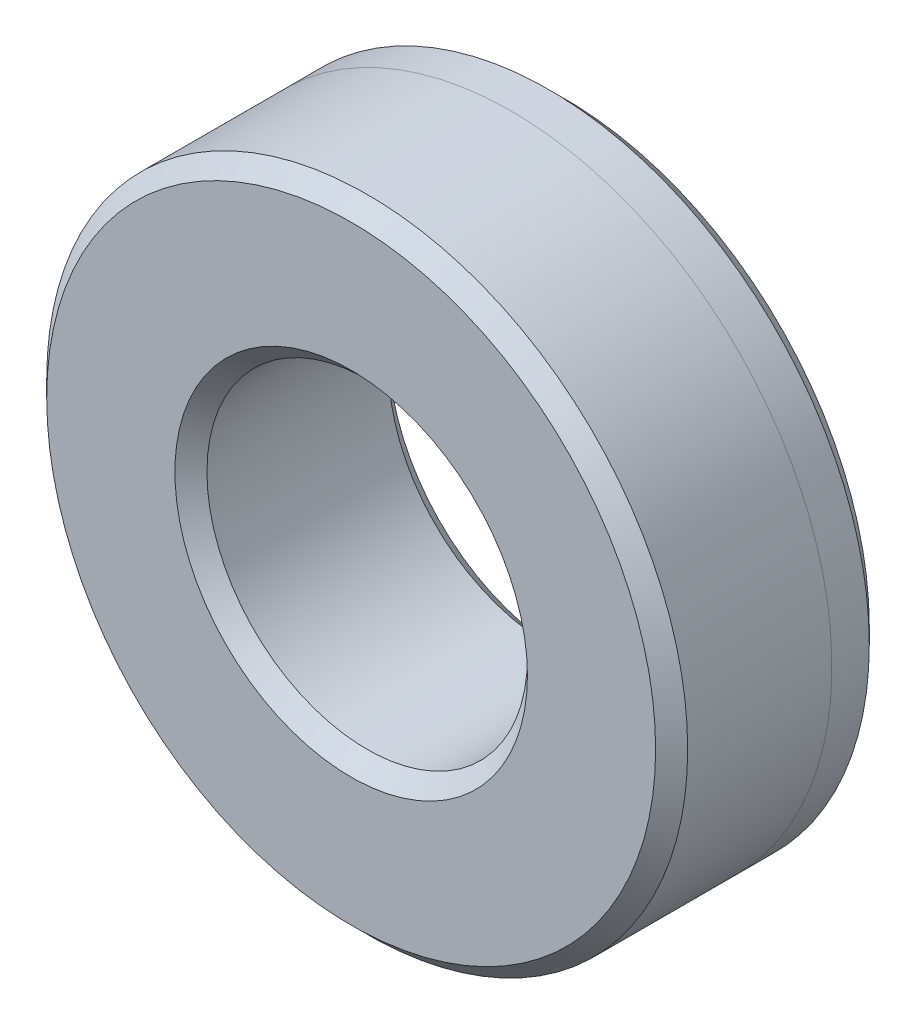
ISO-10303-21;
HEADER;
FILE_DESCRIPTION(('STEP AP214'),'2;1');
FILE_NAME('part.step','',(''),(''),'','','');
FILE_SCHEMA(('AUTOMOTIVE_DESIGN { 1 0 10303 214 1 1 1 1 }'));
ENDSEC;
DATA;
#1=APPLICATION_CONTEXT('core data for automotive mechanical design processes');
#2=APPLICATION_PROTOCOL_DEFINITION('international standard','automotive_design',2000,#1);
#3=PRODUCT_CONTEXT('',#1,'mechanical');
#4=PRODUCT('Part','Part','',(#3));
#5=PRODUCT_RELATED_PRODUCT_CATEGORY('part','',(#4));
#6=PRODUCT_DEFINITION_FORMATION('','',#4);
#7=PRODUCT_DEFINITION_CONTEXT('part definition',#1,'design');
#8=PRODUCT_DEFINITION('design','',#6,#7);
#9=PRODUCT_DEFINITION_SHAPE('','',#8);
#10=(LENGTH_UNIT() NAMED_UNIT(*) SI_UNIT(.MILLI.,.METRE.));
#11=(NAMED_UNIT(*) PLANE_ANGLE_UNIT() SI_UNIT($,.RADIAN.));
#12=(NAMED_UNIT(*) SI_UNIT($,.STERADIAN.) SOLID_ANGLE_UNIT());
#13=UNCERTAINTY_MEASURE_WITH_UNIT(LENGTH_MEASURE(1.E-05),#10,'distance_accuracy_value','');
#14=(GEOMETRIC_REPRESENTATION_CONTEXT(3) GLOBAL_UNCERTAINTY_ASSIGNED_CONTEXT((#13)) GLOBAL_UNIT_ASSIGNED_CONTEXT((#10,
#11,#12)) REPRESENTATION_CONTEXT('',''));
#15=CARTESIAN_POINT('',(0.,0.,0.));
#16=DIRECTION('',(0.,0.,1.));
#17=DIRECTION('',(1.,0.,0.));
#18=AXIS2_PLACEMENT_3D('',#15,#16,#17);
#19=CARTESIAN_POINT('',(0.,0.,1.));
#20=DIRECTION('',(0.,0.,-1.));
#21=DIRECTION('',(-1.,0.,0.));
#22=AXIS2_PLACEMENT_3D('',#19,#20,#21);
#23=CYLINDRICAL_SURFACE('',#22,3.);
#24=CARTESIAN_POINT('',(0.,0.,-0.85));
#25=DIRECTION('',(0.,0.,1.));
#26=DIRECTION('',(1.,0.,0.));
#27=AXIS2_PLACEMENT_3D('',#24,#25,#26);
#28=CIRCLE('',#27,3.);
#29=CARTESIAN_POINT('',(3.,0.,-0.85));
#30=VERTEX_POINT('',#29);
#31=EDGE_CURVE('E40',#30,#30,#28,.T.);
#32=ORIENTED_EDGE('',*,*,#31,.T.);
#33=EDGE_LOOP('',(#32));
#34=FACE_BOUND('',#33,.T.);
#35=CARTESIAN_POINT('',(0.,0.,-0.5));
#36=DIRECTION('',(0.,0.,-1.));
#37=DIRECTION('',(-1.,0.,0.));
#38=AXIS2_PLACEMENT_3D('',#35,#36,#37);
#39=CIRCLE('',#38,3.);
#40=CARTESIAN_POINT('',(-3.,0.,-0.5));
#41=VERTEX_POINT('',#40);
#42=EDGE_CURVE('E11',#41,#41,#39,.T.);
#43=ORIENTED_EDGE('',*,*,#42,.T.);
#44=EDGE_LOOP('',(#43));
#45=FACE_BOUND('',#44,.T.);
#46=ADVANCED_FACE('F33',(#34,#45),#23,.T.);
#47=CARTESIAN_POINT('',(0.,0.,1.));
#48=DIRECTION('',(0.,0.,1.));
#49=DIRECTION('',(1.,0.,0.));
#50=AXIS2_PLACEMENT_3D('',#47,#48,#49);
#51=PLANE('',#50);
#52=CARTESIAN_POINT('',(0.,0.,1.));
#53=DIRECTION('',(0.,0.,1.));
#54=DIRECTION('',(1.,0.,0.));
#55=AXIS2_PLACEMENT_3D('',#52,#53,#54);
#56=CIRCLE('',#55,1.65);
#57=CARTESIAN_POINT('',(1.65,0.,1.));
#58=VERTEX_POINT('',#57);
#59=EDGE_CURVE('E48',#58,#58,#56,.F.);
#60=ORIENTED_EDGE('',*,*,#59,.T.);
#61=EDGE_LOOP('',(#60));
#62=FACE_BOUND('',#61,.T.);
#63=CARTESIAN_POINT('',(0.,0.,1.));
#64=DIRECTION('',(0.,0.,1.));
#65=DIRECTION('',(1.,0.,0.));
#66=AXIS2_PLACEMENT_3D('',#63,#64,#65);
#67=CIRCLE('',#66,2.85);
#68=CARTESIAN_POINT('',(2.85,0.,1.));
#69=VERTEX_POINT('',#68);
#70=EDGE_CURVE('E53',#69,#69,#67,.T.);
#71=ORIENTED_EDGE('',*,*,#70,.T.);
#72=EDGE_LOOP('',(#71));
#73=FACE_BOUND('',#72,.T.);
#74=ADVANCED_FACE('F87',(#62,#73),#51,.T.);
#75=CARTESIAN_POINT('',(0.,0.,-1.));
#76=DIRECTION('',(0.,0.,1.));
#77=DIRECTION('',(1.,0.,0.));
#78=AXIS2_PLACEMENT_3D('',#75,#76,#77);
#79=PLANE('',#78);
#80=CARTESIAN_POINT('',(0.,0.,-1.));
#81=DIRECTION('',(0.,0.,1.));
#82=DIRECTION('',(1.,0.,0.));
#83=AXIS2_PLACEMENT_3D('',#80,#81,#82);
#84=CIRCLE('',#83,1.65);
#85=CARTESIAN_POINT('',(1.65,0.,-1.));
#86=VERTEX_POINT('',#85);
#87=EDGE_CURVE('E62',#86,#86,#84,.T.);
#88=ORIENTED_EDGE('',*,*,#87,.T.);
#89=EDGE_LOOP('',(#88));
#90=FACE_BOUND('',#89,.T.);
#91=CARTESIAN_POINT('',(0.,0.,-1.));
#92=DIRECTION('',(0.,0.,1.));
#93=DIRECTION('',(1.,0.,0.));
#94=AXIS2_PLACEMENT_3D('',#91,#92,#93);
#95=CIRCLE('',#94,2.85);
#96=CARTESIAN_POINT('',(2.85,0.,-1.));
#97=VERTEX_POINT('',#96);
#98=EDGE_CURVE('E65',#97,#97,#95,.F.);
#99=ORIENTED_EDGE('',*,*,#98,.T.);
#100=EDGE_LOOP('',(#99));
#101=FACE_BOUND('',#100,.T.);
#102=ADVANCED_FACE('F69',(#90,#101),#79,.F.);
#103=ORIENTED_EDGE('',*,*,#42,.F.);
#104=EDGE_LOOP('',(#103));
#105=FACE_BOUND('',#104,.T.);
#106=CARTESIAN_POINT('',(0.,0.,0.85));
#107=DIRECTION('',(0.,0.,1.));
#108=DIRECTION('',(1.,0.,0.));
#109=AXIS2_PLACEMENT_3D('',#106,#107,#108);
#110=CIRCLE('',#109,3.);
#111=CARTESIAN_POINT('',(3.,0.,0.85));
#112=VERTEX_POINT('',#111);
#113=EDGE_CURVE('E44',#112,#112,#110,.F.);
#114=ORIENTED_EDGE('',*,*,#113,.T.);
#115=EDGE_LOOP('',(#114));
#116=FACE_BOUND('',#115,.T.);
#117=ADVANCED_FACE('F35',(#105,#116),#23,.T.);
#118=CARTESIAN_POINT('',(0.,0.,1.));
#119=DIRECTION('',(0.,0.,-1.));
#120=DIRECTION('',(-1.,0.,0.));
#121=AXIS2_PLACEMENT_3D('',#118,#119,#120);
#122=CYLINDRICAL_SURFACE('',#121,1.5);
#123=CARTESIAN_POINT('',(0.,0.,-0.85));
#124=DIRECTION('',(0.,0.,1.));
#125=DIRECTION('',(1.,0.,0.));
#126=AXIS2_PLACEMENT_3D('',#123,#124,#125);
#127=CIRCLE('',#126,1.5);
#128=CARTESIAN_POINT('',(1.5,0.,-0.85));
#129=VERTEX_POINT('',#128);
#130=EDGE_CURVE('E56',#129,#129,#127,.F.);
#131=ORIENTED_EDGE('',*,*,#130,.T.);
#132=EDGE_LOOP('',(#131));
#133=FACE_BOUND('',#132,.T.);
#134=CARTESIAN_POINT('',(0.,0.,0.85));
#135=DIRECTION('',(0.,0.,1.));
#136=DIRECTION('',(1.,0.,0.));
#137=AXIS2_PLACEMENT_3D('',#134,#135,#136);
#138=CIRCLE('',#137,1.5);
#139=CARTESIAN_POINT('',(1.5,0.,0.85));
#140=VERTEX_POINT('',#139);
#141=EDGE_CURVE('E59',#140,#140,#138,.T.);
#142=ORIENTED_EDGE('',*,*,#141,.T.);
#143=EDGE_LOOP('',(#142));
#144=FACE_BOUND('',#143,.T.);
#145=ADVANCED_FACE('F93',(#133,#144),#122,.F.);
#146=CARTESIAN_POINT('',(0.,0.,-1.));
#147=DIRECTION('',(0.,0.,-1.));
#148=DIRECTION('',(-1.,0.,0.));
#149=AXIS2_PLACEMENT_3D('',#146,#147,#148);
#150=CONICAL_SURFACE('',#149,1.65,0.785398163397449);
#151=ORIENTED_EDGE('',*,*,#130,.F.);
#152=EDGE_LOOP('',(#151));
#153=FACE_BOUND('',#152,.T.);
#154=ORIENTED_EDGE('',*,*,#87,.F.);
#155=EDGE_LOOP('',(#154));
#156=FACE_BOUND('',#155,.T.);
#157=ADVANCED_FACE('F83',(#153,#156),#150,.F.);
#158=CARTESIAN_POINT('',(0.,0.,0.85));
#159=DIRECTION('',(0.,0.,1.));
#160=DIRECTION('',(1.,0.,0.));
#161=AXIS2_PLACEMENT_3D('',#158,#159,#160);
#162=CONICAL_SURFACE('',#161,1.5,0.785398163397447);
#163=ORIENTED_EDGE('',*,*,#59,.F.);
#164=EDGE_LOOP('',(#163));
#165=FACE_BOUND('',#164,.T.);
#166=ORIENTED_EDGE('',*,*,#141,.F.);
#167=EDGE_LOOP('',(#166));
#168=FACE_BOUND('',#167,.T.);
#169=ADVANCED_FACE('F75',(#165,#168),#162,.F.);
#170=CARTESIAN_POINT('',(0.,0.,-0.85));
#171=DIRECTION('',(0.,0.,1.));
#172=DIRECTION('',(1.,0.,0.));
#173=AXIS2_PLACEMENT_3D('',#170,#171,#172);
#174=CONICAL_SURFACE('',#173,3.,0.785398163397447);
#175=ORIENTED_EDGE('',*,*,#98,.F.);
#176=EDGE_LOOP('',(#175));
#177=FACE_BOUND('',#176,.T.);
#178=ORIENTED_EDGE('',*,*,#31,.F.);
#179=EDGE_LOOP('',(#178));
#180=FACE_BOUND('',#179,.T.);
#181=ADVANCED_FACE('F71',(#177,#180),#174,.T.);
#182=CARTESIAN_POINT('',(0.,0.,1.));
#183=DIRECTION('',(0.,0.,-1.));
#184=DIRECTION('',(-1.,0.,0.));
#185=AXIS2_PLACEMENT_3D('',#182,#183,#184);
#186=CONICAL_SURFACE('',#185,2.85,0.78539816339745);
#187=ORIENTED_EDGE('',*,*,#113,.F.);
#188=EDGE_LOOP('',(#187));
#189=FACE_BOUND('',#188,.T.);
#190=ORIENTED_EDGE('',*,*,#70,.F.);
#191=EDGE_LOOP('',(#190));
#192=FACE_BOUND('',#191,.T.);
#193=ADVANCED_FACE('F74',(#189,#192),#186,.T.);
#194=CLOSED_SHELL('',(#46,#74,#102,#117,#145,#157,#169,#181,#193));
#195=MANIFOLD_SOLID_BREP('B2',#194);
#196=ADVANCED_BREP_SHAPE_REPRESENTATION('',(#18,#195),#14);
#197=SHAPE_DEFINITION_REPRESENTATION(#9,#196);
ENDSEC;
END-ISO-10303-21;
